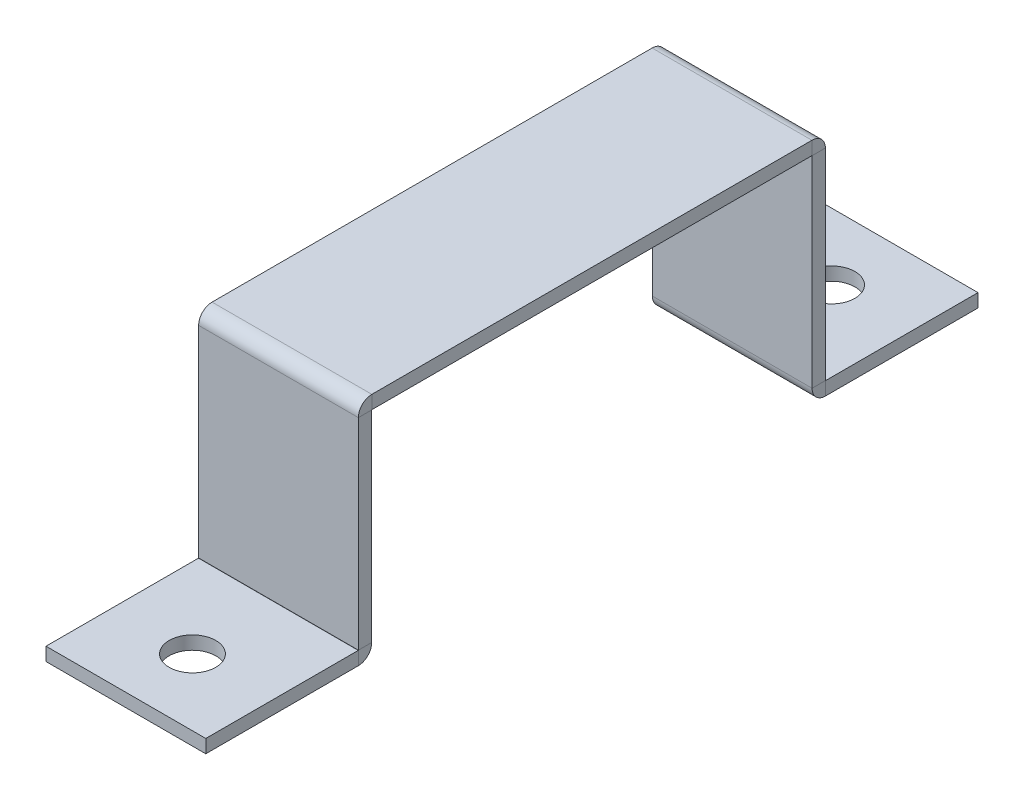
ISO-10303-21;
HEADER;
FILE_DESCRIPTION(('STEP AP214'),'2;1');
FILE_NAME('part.step','',(''),(''),'','','');
FILE_SCHEMA(('AUTOMOTIVE_DESIGN { 1 0 10303 214 1 1 1 1 }'));
ENDSEC;
DATA;
#1=APPLICATION_CONTEXT('core data for automotive mechanical design processes');
#2=APPLICATION_PROTOCOL_DEFINITION('international standard','automotive_design',2000,#1);
#3=PRODUCT_CONTEXT('',#1,'mechanical');
#4=PRODUCT('Part','Part','',(#3));
#5=PRODUCT_RELATED_PRODUCT_CATEGORY('part','',(#4));
#6=PRODUCT_DEFINITION_FORMATION('','',#4);
#7=PRODUCT_DEFINITION_CONTEXT('part definition',#1,'design');
#8=PRODUCT_DEFINITION('design','',#6,#7);
#9=PRODUCT_DEFINITION_SHAPE('','',#8);
#10=(LENGTH_UNIT() NAMED_UNIT(*) SI_UNIT(.MILLI.,.METRE.));
#11=(NAMED_UNIT(*) PLANE_ANGLE_UNIT() SI_UNIT($,.RADIAN.));
#12=(NAMED_UNIT(*) SI_UNIT($,.STERADIAN.) SOLID_ANGLE_UNIT());
#13=UNCERTAINTY_MEASURE_WITH_UNIT(LENGTH_MEASURE(1.E-05),#10,'distance_accuracy_value','');
#14=(GEOMETRIC_REPRESENTATION_CONTEXT(3) GLOBAL_UNCERTAINTY_ASSIGNED_CONTEXT((#13)) GLOBAL_UNIT_ASSIGNED_CONTEXT((#10,
#11,#12)) REPRESENTATION_CONTEXT('',''));
#15=CARTESIAN_POINT('',(0.,0.,0.));
#16=DIRECTION('',(0.,0.,1.));
#17=DIRECTION('',(1.,0.,0.));
#18=AXIS2_PLACEMENT_3D('',#15,#16,#17);
#19=CARTESIAN_POINT('',(0.,62.4635950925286,-62.5364049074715));
#20=DIRECTION('',(1.,0.,0.));
#21=DIRECTION('',(0.,-1.,0.));
#22=AXIS2_PLACEMENT_3D('',#19,#20,#21);
#23=PLANE('',#22);
#24=DIRECTION('',(0.,1.,0.));
#25=VECTOR('',#24,1.);
#26=CARTESIAN_POINT('',(0.,62.4635950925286,-62.5364049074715));
#27=LINE('',#26,#25);
#28=CARTESIAN_POINT('',(0.,-15.1358518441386,-62.5364049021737));
#29=VERTEX_POINT('',#28);
#30=CARTESIAN_POINT('',(0.,-0.0100000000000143,-62.5364049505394));
#31=VERTEX_POINT('',#30);
#32=EDGE_CURVE('E401',#29,#31,#27,.T.);
#33=ORIENTED_EDGE('',*,*,#32,.F.);
#34=DIRECTION('',(0.,0.,1.));
#35=VECTOR('',#34,1.);
#36=CARTESIAN_POINT('',(0.,-15.1358518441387,-62.5364049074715));
#37=LINE('',#36,#35);
#38=CARTESIAN_POINT('',(0.,-15.1358518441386,-61.5364049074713));
#39=VERTEX_POINT('',#38);
#40=EDGE_CURVE('E12',#29,#39,#37,.T.);
#41=ORIENTED_EDGE('',*,*,#40,.T.);
#42=DIRECTION('',(0.,1.,0.));
#43=VECTOR('',#42,1.);
#44=CARTESIAN_POINT('',(0.,62.4635950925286,-61.5364049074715));
#45=LINE('',#44,#43);
#46=CARTESIAN_POINT('',(0.,-0.00999999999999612,-61.5364049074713));
#47=VERTEX_POINT('',#46);
#48=EDGE_CURVE('E321',#39,#47,#45,.T.);
#49=ORIENTED_EDGE('',*,*,#48,.T.);
#50=DIRECTION('',(0.,0.,1.));
#51=VECTOR('',#50,1.);
#52=CARTESIAN_POINT('',(0.,-0.0100000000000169,-62.5364049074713));
#53=LINE('',#52,#51);
#54=EDGE_CURVE('E326',#31,#47,#53,.T.);
#55=ORIENTED_EDGE('',*,*,#54,.F.);
#56=EDGE_LOOP('',(#33,#41,#49,#55));
#57=FACE_BOUND('',#56,.T.);
#58=ADVANCED_FACE('F50',(#57),#23,.F.);
#59=CARTESIAN_POINT('',(12.,62.4635950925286,-62.5364049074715));
#60=DIRECTION('',(-1.,0.,0.));
#61=DIRECTION('',(0.,1.,0.));
#62=AXIS2_PLACEMENT_3D('',#59,#60,#61);
#63=PLANE('',#62);
#64=DIRECTION('',(0.,-1.,0.));
#65=VECTOR('',#64,1.);
#66=CARTESIAN_POINT('',(12.,62.4635950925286,-61.5364049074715));
#67=LINE('',#66,#65);
#68=CARTESIAN_POINT('',(12.,-0.00999999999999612,-61.5364049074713));
#69=VERTEX_POINT('',#68);
#70=CARTESIAN_POINT('',(12.,-15.1358518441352,-61.5364048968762));
#71=VERTEX_POINT('',#70);
#72=EDGE_CURVE('E322',#69,#71,#67,.T.);
#73=ORIENTED_EDGE('',*,*,#72,.T.);
#74=DIRECTION('',(0.,0.,-1.));
#75=VECTOR('',#74,1.);
#76=CARTESIAN_POINT('',(12.,-15.1358518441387,-62.5364049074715));
#77=LINE('',#76,#75);
#78=CARTESIAN_POINT('',(12.,-15.1358518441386,-62.5364049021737));
#79=VERTEX_POINT('',#78);
#80=EDGE_CURVE('E395',#71,#79,#77,.T.);
#81=ORIENTED_EDGE('',*,*,#80,.T.);
#82=DIRECTION('',(0.,-1.,0.));
#83=VECTOR('',#82,1.);
#84=CARTESIAN_POINT('',(12.,62.4635950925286,-62.5364049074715));
#85=LINE('',#84,#83);
#86=CARTESIAN_POINT('',(12.,-0.0100000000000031,-62.5364049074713));
#87=VERTEX_POINT('',#86);
#88=EDGE_CURVE('E53',#87,#79,#85,.T.);
#89=ORIENTED_EDGE('',*,*,#88,.F.);
#90=DIRECTION('',(0.,0.,-1.));
#91=VECTOR('',#90,1.);
#92=CARTESIAN_POINT('',(12.,-0.0100000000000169,-62.5364049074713));
#93=LINE('',#92,#91);
#94=EDGE_CURVE('E323',#69,#87,#93,.T.);
#95=ORIENTED_EDGE('',*,*,#94,.F.);
#96=EDGE_LOOP('',(#73,#81,#89,#95));
#97=FACE_BOUND('',#96,.T.);
#98=ADVANCED_FACE('F411',(#97),#63,.F.);
#99=CARTESIAN_POINT('',(0.,-27.5364049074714,-62.5364049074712));
#100=DIRECTION('',(0.,0.,1.));
#101=DIRECTION('',(0.,-1.,0.));
#102=AXIS2_PLACEMENT_3D('',#99,#100,#101);
#103=PLANE('',#102);
#104=ORIENTED_EDGE('',*,*,#88,.T.);
#105=DIRECTION('',(-1.,0.,0.));
#106=VECTOR('',#105,1.);
#107=CARTESIAN_POINT('',(0.,-15.1358518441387,-62.5364049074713));
#108=LINE('',#107,#106);
#109=EDGE_CURVE('E386',#79,#29,#108,.T.);
#110=ORIENTED_EDGE('',*,*,#109,.T.);
#111=ORIENTED_EDGE('',*,*,#32,.T.);
#112=DIRECTION('',(-1.,0.,0.));
#113=VECTOR('',#112,1.);
#114=CARTESIAN_POINT('',(0.,-0.0100000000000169,-62.5364049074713));
#115=LINE('',#114,#113);
#116=EDGE_CURVE('E317',#87,#31,#115,.T.);
#117=ORIENTED_EDGE('',*,*,#116,.F.);
#118=EDGE_LOOP('',(#104,#110,#111,#117));
#119=FACE_BOUND('',#118,.T.);
#120=ADVANCED_FACE('F407',(#119),#103,.F.);
#121=CARTESIAN_POINT('',(12.,-27.5364049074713,-27.4635950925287));
#122=DIRECTION('',(-1.,0.,0.));
#123=DIRECTION('',(0.,-1.,0.));
#124=AXIS2_PLACEMENT_3D('',#121,#122,#123);
#125=PLANE('',#124);
#126=DIRECTION('',(0.,1.,0.));
#127=VECTOR('',#126,1.);
#128=CARTESIAN_POINT('',(12.,-27.5364049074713,-27.4635950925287));
#129=LINE('',#128,#127);
#130=CARTESIAN_POINT('',(12.,-15.1358518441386,-27.4635950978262));
#131=VERTEX_POINT('',#130);
#132=CARTESIAN_POINT('',(12.,-0.0100000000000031,-27.4635950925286));
#133=VERTEX_POINT('',#132);
#134=EDGE_CURVE('E303',#131,#133,#129,.T.);
#135=ORIENTED_EDGE('',*,*,#134,.F.);
#136=DIRECTION('',(0.,0.,-1.));
#137=VECTOR('',#136,1.);
#138=CARTESIAN_POINT('',(12.,-15.1358518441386,-27.4635950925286));
#139=LINE('',#138,#137);
#140=CARTESIAN_POINT('',(12.,-15.1358518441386,-28.4635950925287));
#141=VERTEX_POINT('',#140);
#142=EDGE_CURVE('E383',#131,#141,#139,.T.);
#143=ORIENTED_EDGE('',*,*,#142,.T.);
#144=DIRECTION('',(0.,1.,0.));
#145=VECTOR('',#144,1.);
#146=CARTESIAN_POINT('',(12.,-27.5364049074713,-28.4635950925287));
#147=LINE('',#146,#145);
#148=CARTESIAN_POINT('',(12.,-0.00999999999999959,-28.4635950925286));
#149=VERTEX_POINT('',#148);
#150=EDGE_CURVE('E294',#141,#149,#147,.T.);
#151=ORIENTED_EDGE('',*,*,#150,.T.);
#152=DIRECTION('',(0.,0.,1.));
#153=VECTOR('',#152,1.);
#154=CARTESIAN_POINT('',(12.,-0.00999999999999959,-27.4635950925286));
#155=LINE('',#154,#153);
#156=EDGE_CURVE('E290',#149,#133,#155,.T.);
#157=ORIENTED_EDGE('',*,*,#156,.T.);
#158=EDGE_LOOP('',(#135,#143,#151,#157));
#159=FACE_BOUND('',#158,.T.);
#160=ADVANCED_FACE('F480',(#159),#125,.F.);
#161=CARTESIAN_POINT('',(0.,-27.5364049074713,-27.4635950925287));
#162=DIRECTION('',(1.,0.,0.));
#163=DIRECTION('',(0.,1.,0.));
#164=AXIS2_PLACEMENT_3D('',#161,#162,#163);
#165=PLANE('',#164);
#166=DIRECTION('',(0.,-1.,0.));
#167=VECTOR('',#166,1.);
#168=CARTESIAN_POINT('',(0.,-27.5364049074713,-28.4635950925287));
#169=LINE('',#168,#167);
#170=CARTESIAN_POINT('',(0.,-0.00999999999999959,-28.4635950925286));
#171=VERTEX_POINT('',#170);
#172=CARTESIAN_POINT('',(0.,-15.1358518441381,-28.4635951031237));
#173=VERTEX_POINT('',#172);
#174=EDGE_CURVE('E298',#171,#173,#169,.T.);
#175=ORIENTED_EDGE('',*,*,#174,.T.);
#176=DIRECTION('',(0.,0.,1.));
#177=VECTOR('',#176,1.);
#178=CARTESIAN_POINT('',(0.,-15.1358518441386,-27.4635950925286));
#179=LINE('',#178,#177);
#180=CARTESIAN_POINT('',(0.,-15.1358518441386,-27.4635950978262));
#181=VERTEX_POINT('',#180);
#182=EDGE_CURVE('E379',#173,#181,#179,.T.);
#183=ORIENTED_EDGE('',*,*,#182,.T.);
#184=DIRECTION('',(0.,-1.,0.));
#185=VECTOR('',#184,1.);
#186=CARTESIAN_POINT('',(0.,-27.5364049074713,-27.4635950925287));
#187=LINE('',#186,#185);
#188=CARTESIAN_POINT('',(0.,-0.00999999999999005,-27.4635951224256));
#189=VERTEX_POINT('',#188);
#190=EDGE_CURVE('E299',#189,#181,#187,.T.);
#191=ORIENTED_EDGE('',*,*,#190,.F.);
#192=DIRECTION('',(0.,0.,-1.));
#193=VECTOR('',#192,1.);
#194=CARTESIAN_POINT('',(0.,-0.00999999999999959,-27.4635950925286));
#195=LINE('',#194,#193);
#196=EDGE_CURVE('E295',#189,#171,#195,.T.);
#197=ORIENTED_EDGE('',*,*,#196,.T.);
#198=EDGE_LOOP('',(#175,#183,#191,#197));
#199=FACE_BOUND('',#198,.T.);
#200=ADVANCED_FACE('F485',(#199),#165,.F.);
#201=CARTESIAN_POINT('',(0.,62.4635950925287,-27.4635950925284));
#202=DIRECTION('',(0.,0.,-1.));
#203=DIRECTION('',(0.,1.,0.));
#204=AXIS2_PLACEMENT_3D('',#201,#202,#203);
#205=PLANE('',#204);
#206=ORIENTED_EDGE('',*,*,#190,.T.);
#207=DIRECTION('',(1.,0.,0.));
#208=VECTOR('',#207,1.);
#209=CARTESIAN_POINT('',(0.,-15.1358518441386,-27.4635950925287));
#210=LINE('',#209,#208);
#211=EDGE_CURVE('E368',#181,#131,#210,.T.);
#212=ORIENTED_EDGE('',*,*,#211,.T.);
#213=ORIENTED_EDGE('',*,*,#134,.T.);
#214=DIRECTION('',(-1.,0.,0.));
#215=VECTOR('',#214,1.);
#216=CARTESIAN_POINT('',(0.,-0.00999999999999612,-27.4635950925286));
#217=LINE('',#216,#215);
#218=EDGE_CURVE('E300',#133,#189,#217,.T.);
#219=ORIENTED_EDGE('',*,*,#218,.T.);
#220=EDGE_LOOP('',(#206,#212,#213,#219));
#221=FACE_BOUND('',#220,.T.);
#222=ADVANCED_FACE('F495',(#221),#205,.F.);
#223=CARTESIAN_POINT('',(0.,0.,-90.));
#224=DIRECTION('',(0.,-1.,0.));
#225=DIRECTION('',(0.,0.,-1.));
#226=AXIS2_PLACEMENT_3D('',#223,#224,#225);
#227=PLANE('',#226);
#228=DIRECTION('',(0.,0.,-1.));
#229=VECTOR('',#228,1.);
#230=CARTESIAN_POINT('',(12.,0.,0.));
#231=LINE('',#230,#229);
#232=CARTESIAN_POINT('',(12.,0.,-28.4735950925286));
#233=VERTEX_POINT('',#232);
#234=CARTESIAN_POINT('',(12.,4.30680556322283E-08,-61.5264049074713));
#235=VERTEX_POINT('',#234);
#236=EDGE_CURVE('E369',#233,#235,#231,.T.);
#237=ORIENTED_EDGE('',*,*,#236,.F.);
#238=DIRECTION('',(-1.,0.,0.));
#239=VECTOR('',#238,1.);
#240=CARTESIAN_POINT('',(0.,0.,-28.4735950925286));
#241=LINE('',#240,#239);
#242=CARTESIAN_POINT('',(0.,0.,-28.4735950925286));
#243=VERTEX_POINT('',#242);
#244=EDGE_CURVE('E362',#233,#243,#241,.T.);
#245=ORIENTED_EDGE('',*,*,#244,.T.);
#246=DIRECTION('',(0.,0.,1.));
#247=VECTOR('',#246,1.);
#248=CARTESIAN_POINT('',(0.,0.,0.));
#249=LINE('',#248,#247);
#250=CARTESIAN_POINT('',(0.,0.,-61.5264049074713));
#251=VERTEX_POINT('',#250);
#252=EDGE_CURVE('E343',#251,#243,#249,.T.);
#253=ORIENTED_EDGE('',*,*,#252,.F.);
#254=DIRECTION('',(-1.,0.,0.));
#255=VECTOR('',#254,1.);
#256=CARTESIAN_POINT('',(0.,0.,-61.5264049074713));
#257=LINE('',#256,#255);
#258=EDGE_CURVE('E351',#235,#251,#257,.T.);
#259=ORIENTED_EDGE('',*,*,#258,.F.);
#260=EDGE_LOOP('',(#237,#245,#253,#259));
#261=FACE_BOUND('',#260,.T.);
#262=ADVANCED_FACE('F499',(#261),#227,.T.);
#263=CARTESIAN_POINT('',(12.,1.,0.));
#264=DIRECTION('',(-1.,0.,0.));
#265=DIRECTION('',(0.,0.,1.));
#266=AXIS2_PLACEMENT_3D('',#263,#264,#265);
#267=PLANE('',#266);
#268=DIRECTION('',(0.,1.,0.));
#269=VECTOR('',#268,1.);
#270=CARTESIAN_POINT('',(12.,0.999999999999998,-28.4735950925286));
#271=LINE('',#270,#269);
#272=CARTESIAN_POINT('',(12.,0.99999999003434,-28.4735950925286));
#273=VERTEX_POINT('',#272);
#274=EDGE_CURVE('E365',#233,#273,#271,.T.);
#275=ORIENTED_EDGE('',*,*,#274,.F.);
#276=ORIENTED_EDGE('',*,*,#236,.T.);
#277=DIRECTION('',(0.,1.,0.));
#278=VECTOR('',#277,1.);
#279=CARTESIAN_POINT('',(12.,0.999999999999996,-61.5264049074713));
#280=LINE('',#279,#278);
#281=CARTESIAN_POINT('',(12.,1.00000002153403,-61.5264049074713));
#282=VERTEX_POINT('',#281);
#283=EDGE_CURVE('E347',#235,#282,#280,.T.);
#284=ORIENTED_EDGE('',*,*,#283,.T.);
#285=DIRECTION('',(0.,0.,-1.));
#286=VECTOR('',#285,1.);
#287=CARTESIAN_POINT('',(12.,1.,0.));
#288=LINE('',#287,#286);
#289=EDGE_CURVE('E348',#273,#282,#288,.T.);
#290=ORIENTED_EDGE('',*,*,#289,.F.);
#291=EDGE_LOOP('',(#275,#276,#284,#290));
#292=FACE_BOUND('',#291,.T.);
#293=ADVANCED_FACE('F452',(#292),#267,.F.);
#294=CARTESIAN_POINT('',(0.,1.,0.));
#295=DIRECTION('',(1.,0.,0.));
#296=DIRECTION('',(0.,0.,-1.));
#297=AXIS2_PLACEMENT_3D('',#294,#295,#296);
#298=PLANE('',#297);
#299=DIRECTION('',(0.,-1.,0.));
#300=VECTOR('',#299,1.);
#301=CARTESIAN_POINT('',(0.,0.999999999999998,-28.4735950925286));
#302=LINE('',#301,#300);
#303=CARTESIAN_POINT('',(0.,1.,-28.4735950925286));
#304=VERTEX_POINT('',#303);
#305=EDGE_CURVE('E359',#304,#243,#302,.T.);
#306=ORIENTED_EDGE('',*,*,#305,.F.);
#307=DIRECTION('',(0.,0.,1.));
#308=VECTOR('',#307,1.);
#309=CARTESIAN_POINT('',(0.,1.,0.));
#310=LINE('',#309,#308);
#311=CARTESIAN_POINT('',(0.,1.00000002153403,-61.5264049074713));
#312=VERTEX_POINT('',#311);
#313=EDGE_CURVE('E372',#312,#304,#310,.T.);
#314=ORIENTED_EDGE('',*,*,#313,.F.);
#315=DIRECTION('',(0.,-1.,0.));
#316=VECTOR('',#315,1.);
#317=CARTESIAN_POINT('',(0.,0.999999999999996,-61.5264049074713));
#318=LINE('',#317,#316);
#319=EDGE_CURVE('E353',#312,#251,#318,.T.);
#320=ORIENTED_EDGE('',*,*,#319,.T.);
#321=ORIENTED_EDGE('',*,*,#252,.T.);
#322=EDGE_LOOP('',(#306,#314,#320,#321));
#323=FACE_BOUND('',#322,.T.);
#324=ADVANCED_FACE('F446',(#323),#298,.F.);
#325=CARTESIAN_POINT('',(0.,1.,-90.));
#326=DIRECTION('',(0.,-1.,0.));
#327=DIRECTION('',(0.,0.,-1.));
#328=AXIS2_PLACEMENT_3D('',#325,#326,#327);
#329=PLANE('',#328);
#330=DIRECTION('',(-1.,0.,0.));
#331=VECTOR('',#330,1.);
#332=CARTESIAN_POINT('',(0.,1.,-28.4735950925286));
#333=LINE('',#332,#331);
#334=EDGE_CURVE('E356',#273,#304,#333,.T.);
#335=ORIENTED_EDGE('',*,*,#334,.F.);
#336=ORIENTED_EDGE('',*,*,#289,.T.);
#337=DIRECTION('',(-1.,0.,0.));
#338=VECTOR('',#337,1.);
#339=CARTESIAN_POINT('',(0.,1.,-61.5264049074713));
#340=LINE('',#339,#338);
#341=EDGE_CURVE('E344',#282,#312,#340,.T.);
#342=ORIENTED_EDGE('',*,*,#341,.T.);
#343=ORIENTED_EDGE('',*,*,#313,.T.);
#344=EDGE_LOOP('',(#335,#336,#342,#343));
#345=FACE_BOUND('',#344,.T.);
#346=ADVANCED_FACE('F449',(#345),#329,.F.);
#347=CARTESIAN_POINT('',(12.,-0.0100000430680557,-61.5264049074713));
#348=DIRECTION('',(1.,0.,0.));
#349=DIRECTION('',(0.,0.,-1.));
#350=AXIS2_PLACEMENT_3D('',#347,#348,#349);
#351=PLANE('',#350);
#352=ORIENTED_EDGE('',*,*,#283,.F.);
#353=CARTESIAN_POINT('',(12.,-0.01,-61.5264049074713));
#354=DIRECTION('',(-1.,0.,0.));
#355=DIRECTION('',(0.,0.,1.));
#356=AXIS2_PLACEMENT_3D('',#353,#354,#355);
#357=CIRCLE('',#356,0.0100000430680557);
#358=EDGE_CURVE('E335',#235,#69,#357,.T.);
#359=ORIENTED_EDGE('',*,*,#358,.T.);
#360=ORIENTED_EDGE('',*,*,#94,.T.);
#361=CARTESIAN_POINT('',(12.,-0.0100000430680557,-61.5264049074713));
#362=DIRECTION('',(-1.,0.,0.));
#363=DIRECTION('',(0.,0.,1.));
#364=AXIS2_PLACEMENT_3D('',#361,#362,#363);
#365=CIRCLE('',#364,1.01000006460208);
#366=EDGE_CURVE('E334',#282,#87,#365,.T.);
#367=ORIENTED_EDGE('',*,*,#366,.F.);
#368=EDGE_LOOP('',(#352,#359,#360,#367));
#369=FACE_BOUND('',#368,.T.);
#370=ADVANCED_FACE('F456',(#369),#351,.T.);
#371=CARTESIAN_POINT('',(0.,-0.0100000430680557,-61.5264049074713));
#372=DIRECTION('',(-1.,0.,0.));
#373=DIRECTION('',(0.,0.,1.));
#374=AXIS2_PLACEMENT_3D('',#371,#372,#373);
#375=PLANE('',#374);
#376=ORIENTED_EDGE('',*,*,#54,.T.);
#377=CARTESIAN_POINT('',(0.,-0.01,-61.5264049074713));
#378=DIRECTION('',(-1.,0.,0.));
#379=DIRECTION('',(0.,0.,1.));
#380=AXIS2_PLACEMENT_3D('',#377,#378,#379);
#381=CIRCLE('',#380,0.0100000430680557);
#382=EDGE_CURVE('E331',#47,#251,#381,.F.);
#383=ORIENTED_EDGE('',*,*,#382,.T.);
#384=ORIENTED_EDGE('',*,*,#319,.F.);
#385=CARTESIAN_POINT('',(0.,-0.0100000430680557,-61.5264049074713));
#386=DIRECTION('',(1.,0.,0.));
#387=DIRECTION('',(0.,0.,-1.));
#388=AXIS2_PLACEMENT_3D('',#385,#386,#387);
#389=CIRCLE('',#388,1.01000006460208);
#390=EDGE_CURVE('E340',#31,#312,#389,.T.);
#391=ORIENTED_EDGE('',*,*,#390,.F.);
#392=EDGE_LOOP('',(#376,#383,#384,#391));
#393=FACE_BOUND('',#392,.T.);
#394=ADVANCED_FACE('F441',(#393),#375,.T.);
#395=CARTESIAN_POINT('',(18.0787900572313,-0.01,-61.5264049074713));
#396=DIRECTION('',(-1.,0.,0.));
#397=DIRECTION('',(0.,0.,1.));
#398=AXIS2_PLACEMENT_3D('',#395,#396,#397);
#399=CYLINDRICAL_SURFACE('',#398,1.01000004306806);
#400=ORIENTED_EDGE('',*,*,#390,.T.);
#401=ORIENTED_EDGE('',*,*,#341,.F.);
#402=ORIENTED_EDGE('',*,*,#366,.T.);
#403=ORIENTED_EDGE('',*,*,#116,.T.);
#404=EDGE_LOOP('',(#400,#401,#402,#403));
#405=FACE_BOUND('',#404,.T.);
#406=ADVANCED_FACE('F439',(#405),#399,.T.);
#407=CARTESIAN_POINT('',(18.0787900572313,-0.01,-61.5264049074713));
#408=DIRECTION('',(-1.,0.,0.));
#409=DIRECTION('',(0.,0.,1.));
#410=AXIS2_PLACEMENT_3D('',#407,#408,#409);
#411=CYLINDRICAL_SURFACE('',#410,0.0100000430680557);
#412=ORIENTED_EDGE('',*,*,#382,.F.);
#413=DIRECTION('',(-1.,0.,0.));
#414=VECTOR('',#413,1.);
#415=CARTESIAN_POINT('',(0.,-0.01000000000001,-61.5364049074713));
#416=LINE('',#415,#414);
#417=EDGE_CURVE('E318',#69,#47,#416,.T.);
#418=ORIENTED_EDGE('',*,*,#417,.F.);
#419=ORIENTED_EDGE('',*,*,#358,.F.);
#420=ORIENTED_EDGE('',*,*,#258,.T.);
#421=EDGE_LOOP('',(#412,#418,#419,#420));
#422=FACE_BOUND('',#421,.T.);
#423=ADVANCED_FACE('F459',(#422),#411,.F.);
#424=CARTESIAN_POINT('',(0.,-27.5364049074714,-61.5364049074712));
#425=DIRECTION('',(0.,0.,1.));
#426=DIRECTION('',(0.,-1.,0.));
#427=AXIS2_PLACEMENT_3D('',#424,#425,#426);
#428=PLANE('',#427);
#429=DIRECTION('',(-1.,0.,0.));
#430=VECTOR('',#429,1.);
#431=CARTESIAN_POINT('',(0.,-15.1358518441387,-61.5364049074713));
#432=LINE('',#431,#430);
#433=EDGE_CURVE('E58',#71,#39,#432,.T.);
#434=ORIENTED_EDGE('',*,*,#433,.F.);
#435=ORIENTED_EDGE('',*,*,#72,.F.);
#436=ORIENTED_EDGE('',*,*,#417,.T.);
#437=ORIENTED_EDGE('',*,*,#48,.F.);
#438=EDGE_LOOP('',(#434,#435,#436,#437));
#439=FACE_BOUND('',#438,.T.);
#440=ADVANCED_FACE('F461',(#439),#428,.T.);
#441=CARTESIAN_POINT('',(12.,-0.00999998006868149,-28.4735950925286));
#442=DIRECTION('',(1.,0.,0.));
#443=DIRECTION('',(0.,0.,-1.));
#444=AXIS2_PLACEMENT_3D('',#441,#442,#443);
#445=PLANE('',#444);
#446=ORIENTED_EDGE('',*,*,#156,.F.);
#447=CARTESIAN_POINT('',(12.,-0.01,-28.4735950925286));
#448=DIRECTION('',(1.,0.,0.));
#449=DIRECTION('',(0.,0.,-1.));
#450=AXIS2_PLACEMENT_3D('',#447,#448,#449);
#451=CIRCLE('',#450,0.00999998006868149);
#452=EDGE_CURVE('E293',#149,#233,#451,.F.);
#453=ORIENTED_EDGE('',*,*,#452,.T.);
#454=ORIENTED_EDGE('',*,*,#274,.T.);
#455=CARTESIAN_POINT('',(12.,-0.00999998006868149,-28.4735950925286));
#456=DIRECTION('',(-1.,0.,0.));
#457=DIRECTION('',(0.,0.,1.));
#458=AXIS2_PLACEMENT_3D('',#455,#456,#457);
#459=CIRCLE('',#458,1.00999997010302);
#460=EDGE_CURVE('E309',#133,#273,#459,.T.);
#461=ORIENTED_EDGE('',*,*,#460,.F.);
#462=EDGE_LOOP('',(#446,#453,#454,#461));
#463=FACE_BOUND('',#462,.T.);
#464=ADVANCED_FACE('F463',(#463),#445,.T.);
#465=CARTESIAN_POINT('',(0.,-0.00999998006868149,-28.4735950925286));
#466=DIRECTION('',(-1.,0.,0.));
#467=DIRECTION('',(0.,0.,1.));
#468=AXIS2_PLACEMENT_3D('',#465,#466,#467);
#469=PLANE('',#468);
#470=ORIENTED_EDGE('',*,*,#305,.T.);
#471=CARTESIAN_POINT('',(0.,-0.01,-28.4735950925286));
#472=DIRECTION('',(1.,0.,0.));
#473=DIRECTION('',(0.,0.,-1.));
#474=AXIS2_PLACEMENT_3D('',#471,#472,#473);
#475=CIRCLE('',#474,0.00999998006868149);
#476=EDGE_CURVE('E306',#243,#171,#475,.T.);
#477=ORIENTED_EDGE('',*,*,#476,.T.);
#478=ORIENTED_EDGE('',*,*,#196,.F.);
#479=CARTESIAN_POINT('',(0.,-0.00999998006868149,-28.4735950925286));
#480=DIRECTION('',(1.,0.,0.));
#481=DIRECTION('',(0.,0.,-1.));
#482=AXIS2_PLACEMENT_3D('',#479,#480,#481);
#483=CIRCLE('',#482,1.00999997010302);
#484=EDGE_CURVE('E314',#304,#189,#483,.T.);
#485=ORIENTED_EDGE('',*,*,#484,.F.);
#486=EDGE_LOOP('',(#470,#477,#478,#485));
#487=FACE_BOUND('',#486,.T.);
#488=ADVANCED_FACE('F468',(#487),#469,.T.);
#489=CARTESIAN_POINT('',(-6.07879005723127,-0.01,-28.4735950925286));
#490=DIRECTION('',(1.,0.,0.));
#491=DIRECTION('',(0.,0.,-1.));
#492=AXIS2_PLACEMENT_3D('',#489,#490,#491);
#493=CYLINDRICAL_SURFACE('',#492,1.00999998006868);
#494=ORIENTED_EDGE('',*,*,#484,.T.);
#495=ORIENTED_EDGE('',*,*,#218,.F.);
#496=ORIENTED_EDGE('',*,*,#460,.T.);
#497=ORIENTED_EDGE('',*,*,#334,.T.);
#498=EDGE_LOOP('',(#494,#495,#496,#497));
#499=FACE_BOUND('',#498,.T.);
#500=ADVANCED_FACE('F518',(#499),#493,.T.);
#501=CARTESIAN_POINT('',(-6.07879005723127,-0.01,-28.4735950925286));
#502=DIRECTION('',(1.,0.,0.));
#503=DIRECTION('',(0.,0.,-1.));
#504=AXIS2_PLACEMENT_3D('',#501,#502,#503);
#505=CYLINDRICAL_SURFACE('',#504,0.00999998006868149);
#506=ORIENTED_EDGE('',*,*,#476,.F.);
#507=ORIENTED_EDGE('',*,*,#244,.F.);
#508=ORIENTED_EDGE('',*,*,#452,.F.);
#509=DIRECTION('',(-1.,0.,0.));
#510=VECTOR('',#509,1.);
#511=CARTESIAN_POINT('',(0.,-0.00999999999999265,-28.4635950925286));
#512=LINE('',#511,#510);
#513=EDGE_CURVE('E289',#149,#171,#512,.T.);
#514=ORIENTED_EDGE('',*,*,#513,.T.);
#515=EDGE_LOOP('',(#506,#507,#508,#514));
#516=FACE_BOUND('',#515,.T.);
#517=ADVANCED_FACE('F491',(#516),#505,.F.);
#518=CARTESIAN_POINT('',(0.,62.4635950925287,-28.4635950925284));
#519=DIRECTION('',(0.,0.,-1.));
#520=DIRECTION('',(0.,1.,0.));
#521=AXIS2_PLACEMENT_3D('',#518,#519,#520);
#522=PLANE('',#521);
#523=DIRECTION('',(1.,0.,0.));
#524=VECTOR('',#523,1.);
#525=CARTESIAN_POINT('',(0.,-15.1358518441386,-28.4635950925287));
#526=LINE('',#525,#524);
#527=EDGE_CURVE('E73',#173,#141,#526,.T.);
#528=ORIENTED_EDGE('',*,*,#527,.F.);
#529=ORIENTED_EDGE('',*,*,#174,.F.);
#530=ORIENTED_EDGE('',*,*,#513,.F.);
#531=ORIENTED_EDGE('',*,*,#150,.F.);
#532=EDGE_LOOP('',(#528,#529,#530,#531));
#533=FACE_BOUND('',#532,.T.);
#534=ADVANCED_FACE('F487',(#533),#522,.T.);
#535=CARTESIAN_POINT('',(0.,-15.1358518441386,-27.4535950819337));
#536=DIRECTION('',(1.,0.,0.));
#537=DIRECTION('',(0.,0.,-1.));
#538=AXIS2_PLACEMENT_3D('',#535,#536,#537);
#539=PLANE('',#538);
#540=ORIENTED_EDGE('',*,*,#182,.F.);
#541=CARTESIAN_POINT('',(0.,-15.1358518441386,-27.4535950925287));
#542=DIRECTION('',(1.,0.,0.));
#543=DIRECTION('',(0.,0.,-1.));
#544=AXIS2_PLACEMENT_3D('',#541,#542,#543);
#545=CIRCLE('',#544,1.01000001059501);
#546=CARTESIAN_POINT('',(0.,-16.1458518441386,-27.4535950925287));
#547=VERTEX_POINT('',#546);
#548=EDGE_CURVE('E244',#173,#547,#545,.F.);
#549=ORIENTED_EDGE('',*,*,#548,.T.);
#550=DIRECTION('',(0.,1.,0.));
#551=VECTOR('',#550,1.);
#552=CARTESIAN_POINT('',(0.,-15.1458518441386,-27.4535950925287));
#553=LINE('',#552,#551);
#554=CARTESIAN_POINT('',(0.,-15.1458518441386,-27.4535950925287));
#555=VERTEX_POINT('',#554);
#556=EDGE_CURVE('E271',#547,#555,#553,.T.);
#557=ORIENTED_EDGE('',*,*,#556,.T.);
#558=CARTESIAN_POINT('',(0.,-15.1358518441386,-27.4535950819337));
#559=DIRECTION('',(-1.,0.,0.));
#560=DIRECTION('',(0.,0.,1.));
#561=AXIS2_PLACEMENT_3D('',#558,#559,#560);
#562=CIRCLE('',#561,0.0100000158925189);
#563=EDGE_CURVE('E281',#181,#555,#562,.T.);
#564=ORIENTED_EDGE('',*,*,#563,.F.);
#565=EDGE_LOOP('',(#540,#549,#557,#564));
#566=FACE_BOUND('',#565,.T.);
#567=ADVANCED_FACE('F490',(#566),#539,.F.);
#568=CARTESIAN_POINT('',(12.,-15.1358518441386,-27.4535950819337));
#569=DIRECTION('',(-1.,0.,0.));
#570=DIRECTION('',(0.,0.,1.));
#571=AXIS2_PLACEMENT_3D('',#568,#569,#570);
#572=PLANE('',#571);
#573=DIRECTION('',(0.,-1.,0.));
#574=VECTOR('',#573,1.);
#575=CARTESIAN_POINT('',(12.,-15.1458518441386,-27.4535950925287));
#576=LINE('',#575,#574);
#577=CARTESIAN_POINT('',(12.,-15.1458518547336,-27.4535950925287));
#578=VERTEX_POINT('',#577);
#579=CARTESIAN_POINT('',(12.,-16.1458518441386,-27.4535950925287));
#580=VERTEX_POINT('',#579);
#581=EDGE_CURVE('E274',#578,#580,#576,.T.);
#582=ORIENTED_EDGE('',*,*,#581,.T.);
#583=CARTESIAN_POINT('',(12.,-15.1358518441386,-27.4535950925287));
#584=DIRECTION('',(1.,0.,0.));
#585=DIRECTION('',(0.,0.,-1.));
#586=AXIS2_PLACEMENT_3D('',#583,#584,#585);
#587=CIRCLE('',#586,1.01000001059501);
#588=EDGE_CURVE('E279',#580,#141,#587,.T.);
#589=ORIENTED_EDGE('',*,*,#588,.T.);
#590=ORIENTED_EDGE('',*,*,#142,.F.);
#591=CARTESIAN_POINT('',(12.,-15.1358518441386,-27.4535950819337));
#592=DIRECTION('',(1.,0.,0.));
#593=DIRECTION('',(0.,0.,-1.));
#594=AXIS2_PLACEMENT_3D('',#591,#592,#593);
#595=CIRCLE('',#594,0.0100000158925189);
#596=EDGE_CURVE('E286',#578,#131,#595,.T.);
#597=ORIENTED_EDGE('',*,*,#596,.F.);
#598=EDGE_LOOP('',(#582,#589,#590,#597));
#599=FACE_BOUND('',#598,.T.);
#600=ADVANCED_FACE('F528',(#599),#572,.F.);
#601=CARTESIAN_POINT('',(-6.07879005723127,-15.1358518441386,-27.4535950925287));
#602=DIRECTION('',(1.,0.,0.));
#603=DIRECTION('',(0.,0.,-1.));
#604=AXIS2_PLACEMENT_3D('',#601,#602,#603);
#605=CYLINDRICAL_SURFACE('',#604,0.01000001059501);
#606=ORIENTED_EDGE('',*,*,#596,.T.);
#607=ORIENTED_EDGE('',*,*,#211,.F.);
#608=ORIENTED_EDGE('',*,*,#563,.T.);
#609=DIRECTION('',(1.,0.,0.));
#610=VECTOR('',#609,1.);
#611=CARTESIAN_POINT('',(0.,-15.1458518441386,-27.4535950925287));
#612=LINE('',#611,#610);
#613=EDGE_CURVE('E241',#555,#578,#612,.T.);
#614=ORIENTED_EDGE('',*,*,#613,.T.);
#615=EDGE_LOOP('',(#606,#607,#608,#614));
#616=FACE_BOUND('',#615,.T.);
#617=ADVANCED_FACE('F532',(#616),#605,.F.);
#618=CARTESIAN_POINT('',(-6.07879005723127,-15.1358518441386,-27.4535950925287));
#619=DIRECTION('',(1.,0.,0.));
#620=DIRECTION('',(0.,0.,-1.));
#621=AXIS2_PLACEMENT_3D('',#618,#619,#620);
#622=CYLINDRICAL_SURFACE('',#621,1.01000001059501);
#623=ORIENTED_EDGE('',*,*,#588,.F.);
#624=DIRECTION('',(1.,0.,0.));
#625=VECTOR('',#624,1.);
#626=CARTESIAN_POINT('',(0.,-16.1458518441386,-27.4535950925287));
#627=LINE('',#626,#625);
#628=EDGE_CURVE('E248',#547,#580,#627,.T.);
#629=ORIENTED_EDGE('',*,*,#628,.F.);
#630=ORIENTED_EDGE('',*,*,#548,.F.);
#631=ORIENTED_EDGE('',*,*,#527,.T.);
#632=EDGE_LOOP('',(#623,#629,#630,#631));
#633=FACE_BOUND('',#632,.T.);
#634=ADVANCED_FACE('F536',(#633),#622,.T.);
#635=CARTESIAN_POINT('',(6.,-15.1458518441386,-21.0002322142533));
#636=DIRECTION('',(0.,-1.,0.));
#637=DIRECTION('',(0.,0.,-1.));
#638=AXIS2_PLACEMENT_3D('',#635,#636,#637);
#639=CYLINDRICAL_SURFACE('',#638,1.75);
#640=CARTESIAN_POINT('',(6.,-15.1458518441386,-21.0002322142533));
#641=DIRECTION('',(0.,1.,0.));
#642=DIRECTION('',(0.,0.,1.));
#643=AXIS2_PLACEMENT_3D('',#640,#641,#642);
#644=CIRCLE('',#643,1.75);
#645=CARTESIAN_POINT('',(6.,-15.1458518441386,-19.2502322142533));
#646=VERTEX_POINT('',#645);
#647=EDGE_CURVE('E268',#646,#646,#644,.T.);
#648=ORIENTED_EDGE('',*,*,#647,.T.);
#649=EDGE_LOOP('',(#648));
#650=FACE_BOUND('',#649,.T.);
#651=CARTESIAN_POINT('',(6.,-16.1458518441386,-21.0002322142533));
#652=DIRECTION('',(0.,1.,0.));
#653=DIRECTION('',(0.,0.,1.));
#654=AXIS2_PLACEMENT_3D('',#651,#652,#653);
#655=CIRCLE('',#654,1.75);
#656=CARTESIAN_POINT('',(6.,-16.1458518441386,-19.2502322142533));
#657=VERTEX_POINT('',#656);
#658=EDGE_CURVE('E251',#657,#657,#655,.T.);
#659=ORIENTED_EDGE('',*,*,#658,.F.);
#660=EDGE_LOOP('',(#659));
#661=FACE_BOUND('',#660,.T.);
#662=ADVANCED_FACE('F540',(#650,#661),#639,.F.);
#663=CARTESIAN_POINT('',(0.,-15.1458518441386,-16.0002322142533));
#664=DIRECTION('',(0.,0.,-1.));
#665=DIRECTION('',(-1.,0.,0.));
#666=AXIS2_PLACEMENT_3D('',#663,#664,#665);
#667=PLANE('',#666);
#668=DIRECTION('',(1.,0.,0.));
#669=VECTOR('',#668,1.);
#670=CARTESIAN_POINT('',(0.,-16.1458518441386,-16.0002322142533));
#671=LINE('',#670,#669);
#672=CARTESIAN_POINT('',(0.,-16.1458518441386,-16.0002322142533));
#673=VERTEX_POINT('',#672);
#674=CARTESIAN_POINT('',(12.,-16.1458518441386,-16.0002322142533));
#675=VERTEX_POINT('',#674);
#676=EDGE_CURVE('E266',#673,#675,#671,.T.);
#677=ORIENTED_EDGE('',*,*,#676,.T.);
#678=DIRECTION('',(0.,-1.,0.));
#679=VECTOR('',#678,1.);
#680=CARTESIAN_POINT('',(12.,-15.1458518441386,-16.0002322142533));
#681=LINE('',#680,#679);
#682=CARTESIAN_POINT('',(12.,-15.1458518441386,-16.0002322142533));
#683=VERTEX_POINT('',#682);
#684=EDGE_CURVE('E245',#683,#675,#681,.T.);
#685=ORIENTED_EDGE('',*,*,#684,.F.);
#686=DIRECTION('',(1.,0.,0.));
#687=VECTOR('',#686,1.);
#688=CARTESIAN_POINT('',(0.,-15.1458518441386,-16.0002322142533));
#689=LINE('',#688,#687);
#690=CARTESIAN_POINT('',(0.,-15.1458518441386,-16.0002322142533));
#691=VERTEX_POINT('',#690);
#692=EDGE_CURVE('E259',#691,#683,#689,.T.);
#693=ORIENTED_EDGE('',*,*,#692,.F.);
#694=DIRECTION('',(0.,-1.,0.));
#695=VECTOR('',#694,1.);
#696=CARTESIAN_POINT('',(0.,-15.1458518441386,-16.0002322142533));
#697=LINE('',#696,#695);
#698=EDGE_CURVE('E263',#691,#673,#697,.T.);
#699=ORIENTED_EDGE('',*,*,#698,.T.);
#700=EDGE_LOOP('',(#677,#685,#693,#699));
#701=FACE_BOUND('',#700,.T.);
#702=ADVANCED_FACE('F556',(#701),#667,.F.);
#703=CARTESIAN_POINT('',(0.,-15.1458518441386,-106.000232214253));
#704=DIRECTION('',(0.,-1.,0.));
#705=DIRECTION('',(0.,0.,-1.));
#706=AXIS2_PLACEMENT_3D('',#703,#704,#705);
#707=PLANE('',#706);
#708=ORIENTED_EDGE('',*,*,#613,.F.);
#709=DIRECTION('',(0.,0.,1.));
#710=VECTOR('',#709,1.);
#711=CARTESIAN_POINT('',(0.,-15.1458518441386,-16.0002322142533));
#712=LINE('',#711,#710);
#713=EDGE_CURVE('E261',#555,#691,#712,.T.);
#714=ORIENTED_EDGE('',*,*,#713,.T.);
#715=ORIENTED_EDGE('',*,*,#692,.T.);
#716=DIRECTION('',(0.,0.,-1.));
#717=VECTOR('',#716,1.);
#718=CARTESIAN_POINT('',(12.,-15.1458518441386,-16.0002322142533));
#719=LINE('',#718,#717);
#720=EDGE_CURVE('E256',#683,#578,#719,.T.);
#721=ORIENTED_EDGE('',*,*,#720,.T.);
#722=EDGE_LOOP('',(#708,#714,#715,#721));
#723=FACE_BOUND('',#722,.T.);
#724=ORIENTED_EDGE('',*,*,#647,.F.);
#725=EDGE_LOOP('',(#724));
#726=FACE_BOUND('',#725,.T.);
#727=ADVANCED_FACE('F552',(#723,#726),#707,.F.);
#728=CARTESIAN_POINT('',(0.,-15.1458518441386,-16.0002322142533));
#729=DIRECTION('',(1.,0.,0.));
#730=DIRECTION('',(0.,0.,-1.));
#731=AXIS2_PLACEMENT_3D('',#728,#729,#730);
#732=PLANE('',#731);
#733=ORIENTED_EDGE('',*,*,#556,.F.);
#734=DIRECTION('',(0.,0.,1.));
#735=VECTOR('',#734,1.);
#736=CARTESIAN_POINT('',(0.,-16.1458518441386,-16.0002322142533));
#737=LINE('',#736,#735);
#738=EDGE_CURVE('E254',#547,#673,#737,.T.);
#739=ORIENTED_EDGE('',*,*,#738,.T.);
#740=ORIENTED_EDGE('',*,*,#698,.F.);
#741=ORIENTED_EDGE('',*,*,#713,.F.);
#742=EDGE_LOOP('',(#733,#739,#740,#741));
#743=FACE_BOUND('',#742,.T.);
#744=ADVANCED_FACE('F548',(#743),#732,.F.);
#745=CARTESIAN_POINT('',(0.,-16.1458518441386,-106.000232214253));
#746=DIRECTION('',(0.,-1.,0.));
#747=DIRECTION('',(0.,0.,-1.));
#748=AXIS2_PLACEMENT_3D('',#745,#746,#747);
#749=PLANE('',#748);
#750=ORIENTED_EDGE('',*,*,#658,.T.);
#751=EDGE_LOOP('',(#750));
#752=FACE_BOUND('',#751,.T.);
#753=ORIENTED_EDGE('',*,*,#738,.F.);
#754=ORIENTED_EDGE('',*,*,#628,.T.);
#755=DIRECTION('',(0.,0.,-1.));
#756=VECTOR('',#755,1.);
#757=CARTESIAN_POINT('',(12.,-16.1458518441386,-16.0002322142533));
#758=LINE('',#757,#756);
#759=EDGE_CURVE('E242',#675,#580,#758,.T.);
#760=ORIENTED_EDGE('',*,*,#759,.F.);
#761=ORIENTED_EDGE('',*,*,#676,.F.);
#762=EDGE_LOOP('',(#753,#754,#760,#761));
#763=FACE_BOUND('',#762,.T.);
#764=ADVANCED_FACE('F544',(#752,#763),#749,.T.);
#765=CARTESIAN_POINT('',(12.,-15.1458518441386,-16.0002322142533));
#766=DIRECTION('',(-1.,0.,0.));
#767=DIRECTION('',(0.,0.,1.));
#768=AXIS2_PLACEMENT_3D('',#765,#766,#767);
#769=PLANE('',#768);
#770=ORIENTED_EDGE('',*,*,#581,.F.);
#771=ORIENTED_EDGE('',*,*,#720,.F.);
#772=ORIENTED_EDGE('',*,*,#684,.T.);
#773=ORIENTED_EDGE('',*,*,#759,.T.);
#774=EDGE_LOOP('',(#770,#771,#772,#773));
#775=FACE_BOUND('',#774,.T.);
#776=ADVANCED_FACE('F541',(#775),#769,.F.);
#777=CARTESIAN_POINT('',(12.,-15.1358518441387,-62.5464049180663));
#778=DIRECTION('',(-1.,0.,0.));
#779=DIRECTION('',(0.,0.,1.));
#780=AXIS2_PLACEMENT_3D('',#777,#778,#779);
#781=PLANE('',#780);
#782=ORIENTED_EDGE('',*,*,#80,.F.);
#783=CARTESIAN_POINT('',(12.,-15.1358518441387,-62.5464049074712));
#784=DIRECTION('',(-1.,0.,0.));
#785=DIRECTION('',(0.,0.,1.));
#786=AXIS2_PLACEMENT_3D('',#783,#784,#785);
#787=CIRCLE('',#786,1.01000001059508);
#788=CARTESIAN_POINT('',(12.,-16.1458518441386,-62.5464049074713));
#789=VERTEX_POINT('',#788);
#790=EDGE_CURVE('E233',#71,#789,#787,.F.);
#791=ORIENTED_EDGE('',*,*,#790,.T.);
#792=DIRECTION('',(0.,1.,0.));
#793=VECTOR('',#792,1.);
#794=CARTESIAN_POINT('',(12.,-15.1458518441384,-62.5464049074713));
#795=LINE('',#794,#793);
#796=CARTESIAN_POINT('',(12.,-15.1458518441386,-62.5464049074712));
#797=VERTEX_POINT('',#796);
#798=EDGE_CURVE('E198',#789,#797,#795,.T.);
#799=ORIENTED_EDGE('',*,*,#798,.T.);
#800=CARTESIAN_POINT('',(12.,-15.1358518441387,-62.5464049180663));
#801=DIRECTION('',(1.,0.,0.));
#802=DIRECTION('',(0.,0.,-1.));
#803=AXIS2_PLACEMENT_3D('',#800,#801,#802);
#804=CIRCLE('',#803,0.0100000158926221);
#805=EDGE_CURVE('E232',#79,#797,#804,.T.);
#806=ORIENTED_EDGE('',*,*,#805,.F.);
#807=EDGE_LOOP('',(#782,#791,#799,#806));
#808=FACE_BOUND('',#807,.T.);
#809=ADVANCED_FACE('F413',(#808),#781,.F.);
#810=CARTESIAN_POINT('',(0.,-15.1358518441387,-62.5464049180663));
#811=DIRECTION('',(1.,0.,0.));
#812=DIRECTION('',(0.,0.,-1.));
#813=AXIS2_PLACEMENT_3D('',#810,#811,#812);
#814=PLANE('',#813);
#815=DIRECTION('',(0.,-1.,0.));
#816=VECTOR('',#815,1.);
#817=CARTESIAN_POINT('',(0.,-15.1458518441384,-62.5464049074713));
#818=LINE('',#817,#816);
#819=CARTESIAN_POINT('',(0.,-15.1458518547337,-62.5464049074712));
#820=VERTEX_POINT('',#819);
#821=CARTESIAN_POINT('',(0.,-16.1458518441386,-62.5464049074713));
#822=VERTEX_POINT('',#821);
#823=EDGE_CURVE('E224',#820,#822,#818,.T.);
#824=ORIENTED_EDGE('',*,*,#823,.T.);
#825=CARTESIAN_POINT('',(0.,-15.1358518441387,-62.5464049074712));
#826=DIRECTION('',(-1.,0.,0.));
#827=DIRECTION('',(0.,0.,1.));
#828=AXIS2_PLACEMENT_3D('',#825,#826,#827);
#829=CIRCLE('',#828,1.01000001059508);
#830=EDGE_CURVE('E230',#822,#39,#829,.T.);
#831=ORIENTED_EDGE('',*,*,#830,.T.);
#832=ORIENTED_EDGE('',*,*,#40,.F.);
#833=CARTESIAN_POINT('',(0.,-15.1358518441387,-62.5464049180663));
#834=DIRECTION('',(-1.,0.,0.));
#835=DIRECTION('',(0.,0.,1.));
#836=AXIS2_PLACEMENT_3D('',#833,#834,#835);
#837=CIRCLE('',#836,0.0100000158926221);
#838=EDGE_CURVE('E238',#820,#29,#837,.T.);
#839=ORIENTED_EDGE('',*,*,#838,.F.);
#840=EDGE_LOOP('',(#824,#831,#832,#839));
#841=FACE_BOUND('',#840,.T.);
#842=ADVANCED_FACE('F432',(#841),#814,.F.);
#843=CARTESIAN_POINT('',(18.0787900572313,-15.1358518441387,-62.5464049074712));
#844=DIRECTION('',(-1.,0.,0.));
#845=DIRECTION('',(0.,0.,1.));
#846=AXIS2_PLACEMENT_3D('',#843,#844,#845);
#847=CYLINDRICAL_SURFACE('',#846,0.0100000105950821);
#848=ORIENTED_EDGE('',*,*,#838,.T.);
#849=ORIENTED_EDGE('',*,*,#109,.F.);
#850=ORIENTED_EDGE('',*,*,#805,.T.);
#851=DIRECTION('',(-1.,0.,0.));
#852=VECTOR('',#851,1.);
#853=CARTESIAN_POINT('',(0.,-15.1458518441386,-62.5464049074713));
#854=LINE('',#853,#852);
#855=EDGE_CURVE('E227',#797,#820,#854,.T.);
#856=ORIENTED_EDGE('',*,*,#855,.T.);
#857=EDGE_LOOP('',(#848,#849,#850,#856));
#858=FACE_BOUND('',#857,.T.);
#859=ADVANCED_FACE('F429',(#858),#847,.F.);
#860=CARTESIAN_POINT('',(18.0787900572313,-15.1358518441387,-62.5464049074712));
#861=DIRECTION('',(-1.,0.,0.));
#862=DIRECTION('',(0.,0.,1.));
#863=AXIS2_PLACEMENT_3D('',#860,#861,#862);
#864=CYLINDRICAL_SURFACE('',#863,1.01000001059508);
#865=ORIENTED_EDGE('',*,*,#830,.F.);
#866=DIRECTION('',(-1.,0.,0.));
#867=VECTOR('',#866,1.);
#868=CARTESIAN_POINT('',(0.,-16.1458518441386,-62.5464049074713));
#869=LINE('',#868,#867);
#870=EDGE_CURVE('E415',#789,#822,#869,.T.);
#871=ORIENTED_EDGE('',*,*,#870,.F.);
#872=ORIENTED_EDGE('',*,*,#790,.F.);
#873=ORIENTED_EDGE('',*,*,#433,.T.);
#874=EDGE_LOOP('',(#865,#871,#872,#873));
#875=FACE_BOUND('',#874,.T.);
#876=ADVANCED_FACE('F414',(#875),#864,.T.);
#877=CARTESIAN_POINT('',(6.,-15.1458518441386,-68.9997677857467));
#878=DIRECTION('',(0.,-1.,0.));
#879=DIRECTION('',(0.,0.,-1.));
#880=AXIS2_PLACEMENT_3D('',#877,#878,#879);
#881=CYLINDRICAL_SURFACE('',#880,1.75);
#882=CARTESIAN_POINT('',(6.,-15.1458518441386,-68.9997677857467));
#883=DIRECTION('',(0.,1.,0.));
#884=DIRECTION('',(0.,0.,1.));
#885=AXIS2_PLACEMENT_3D('',#882,#883,#884);
#886=CIRCLE('',#885,1.75);
#887=CARTESIAN_POINT('',(6.,-15.1458518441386,-67.2497677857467));
#888=VERTEX_POINT('',#887);
#889=EDGE_CURVE('E217',#888,#888,#886,.T.);
#890=ORIENTED_EDGE('',*,*,#889,.T.);
#891=EDGE_LOOP('',(#890));
#892=FACE_BOUND('',#891,.T.);
#893=CARTESIAN_POINT('',(6.,-16.1458518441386,-68.9997677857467));
#894=DIRECTION('',(0.,1.,0.));
#895=DIRECTION('',(0.,0.,1.));
#896=AXIS2_PLACEMENT_3D('',#893,#894,#895);
#897=CIRCLE('',#896,1.75);
#898=CARTESIAN_POINT('',(6.,-16.1458518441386,-67.2497677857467));
#899=VERTEX_POINT('',#898);
#900=EDGE_CURVE('E203',#899,#899,#897,.T.);
#901=ORIENTED_EDGE('',*,*,#900,.F.);
#902=EDGE_LOOP('',(#901));
#903=FACE_BOUND('',#902,.T.);
#904=ADVANCED_FACE('F572',(#892,#903),#881,.F.);
#905=CARTESIAN_POINT('',(0.,-15.1458518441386,-73.9997677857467));
#906=DIRECTION('',(0.,0.,1.));
#907=DIRECTION('',(1.,0.,0.));
#908=AXIS2_PLACEMENT_3D('',#905,#906,#907);
#909=PLANE('',#908);
#910=DIRECTION('',(-1.,0.,0.));
#911=VECTOR('',#910,1.);
#912=CARTESIAN_POINT('',(0.,-16.1458518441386,-73.9997677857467));
#913=LINE('',#912,#911);
#914=CARTESIAN_POINT('',(12.,-16.1458518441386,-73.9997677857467));
#915=VERTEX_POINT('',#914);
#916=CARTESIAN_POINT('',(0.,-16.1458518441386,-73.9997677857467));
#917=VERTEX_POINT('',#916);
#918=EDGE_CURVE('E209',#915,#917,#913,.T.);
#919=ORIENTED_EDGE('',*,*,#918,.T.);
#920=DIRECTION('',(0.,-1.,0.));
#921=VECTOR('',#920,1.);
#922=CARTESIAN_POINT('',(0.,-15.1458518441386,-73.9997677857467));
#923=LINE('',#922,#921);
#924=CARTESIAN_POINT('',(0.,-15.1458518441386,-73.9997677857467));
#925=VERTEX_POINT('',#924);
#926=EDGE_CURVE('E416',#925,#917,#923,.T.);
#927=ORIENTED_EDGE('',*,*,#926,.F.);
#928=DIRECTION('',(-1.,0.,0.));
#929=VECTOR('',#928,1.);
#930=CARTESIAN_POINT('',(0.,-15.1458518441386,-73.9997677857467));
#931=LINE('',#930,#929);
#932=CARTESIAN_POINT('',(12.,-15.1458518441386,-73.9997677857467));
#933=VERTEX_POINT('',#932);
#934=EDGE_CURVE('E211',#933,#925,#931,.T.);
#935=ORIENTED_EDGE('',*,*,#934,.F.);
#936=DIRECTION('',(0.,-1.,0.));
#937=VECTOR('',#936,1.);
#938=CARTESIAN_POINT('',(12.,-15.1458518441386,-73.9997677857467));
#939=LINE('',#938,#937);
#940=EDGE_CURVE('E195',#933,#915,#939,.T.);
#941=ORIENTED_EDGE('',*,*,#940,.T.);
#942=EDGE_LOOP('',(#919,#927,#935,#941));
#943=FACE_BOUND('',#942,.T.);
#944=ADVANCED_FACE('F207',(#943),#909,.F.);
#945=CARTESIAN_POINT('',(0.,-15.1458518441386,-73.9997677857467));
#946=DIRECTION('',(0.,-1.,0.));
#947=DIRECTION('',(0.,0.,-1.));
#948=AXIS2_PLACEMENT_3D('',#945,#946,#947);
#949=PLANE('',#948);
#950=ORIENTED_EDGE('',*,*,#855,.F.);
#951=DIRECTION('',(0.,0.,-1.));
#952=VECTOR('',#951,1.);
#953=CARTESIAN_POINT('',(12.,-15.1458518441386,16.0002322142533));
#954=LINE('',#953,#952);
#955=EDGE_CURVE('E212',#797,#933,#954,.T.);
#956=ORIENTED_EDGE('',*,*,#955,.T.);
#957=ORIENTED_EDGE('',*,*,#934,.T.);
#958=DIRECTION('',(0.,0.,1.));
#959=VECTOR('',#958,1.);
#960=CARTESIAN_POINT('',(0.,-15.1458518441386,16.0002322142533));
#961=LINE('',#960,#959);
#962=EDGE_CURVE('E204',#925,#820,#961,.T.);
#963=ORIENTED_EDGE('',*,*,#962,.T.);
#964=EDGE_LOOP('',(#950,#956,#957,#963));
#965=FACE_BOUND('',#964,.T.);
#966=ORIENTED_EDGE('',*,*,#889,.F.);
#967=EDGE_LOOP('',(#966));
#968=FACE_BOUND('',#967,.T.);
#969=ADVANCED_FACE('F426',(#965,#968),#949,.F.);
#970=CARTESIAN_POINT('',(12.,-15.1458518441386,16.0002322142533));
#971=DIRECTION('',(-1.,0.,0.));
#972=DIRECTION('',(0.,0.,1.));
#973=AXIS2_PLACEMENT_3D('',#970,#971,#972);
#974=PLANE('',#973);
#975=ORIENTED_EDGE('',*,*,#798,.F.);
#976=DIRECTION('',(0.,0.,-1.));
#977=VECTOR('',#976,1.);
#978=CARTESIAN_POINT('',(12.,-16.1458518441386,16.0002322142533));
#979=LINE('',#978,#977);
#980=EDGE_CURVE('E191',#789,#915,#979,.T.);
#981=ORIENTED_EDGE('',*,*,#980,.T.);
#982=ORIENTED_EDGE('',*,*,#940,.F.);
#983=ORIENTED_EDGE('',*,*,#955,.F.);
#984=EDGE_LOOP('',(#975,#981,#982,#983));
#985=FACE_BOUND('',#984,.T.);
#986=ADVANCED_FACE('F193',(#985),#974,.F.);
#987=CARTESIAN_POINT('',(0.,-16.1458518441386,-73.9997677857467));
#988=DIRECTION('',(0.,-1.,0.));
#989=DIRECTION('',(0.,0.,-1.));
#990=AXIS2_PLACEMENT_3D('',#987,#988,#989);
#991=PLANE('',#990);
#992=ORIENTED_EDGE('',*,*,#900,.T.);
#993=EDGE_LOOP('',(#992));
#994=FACE_BOUND('',#993,.T.);
#995=ORIENTED_EDGE('',*,*,#980,.F.);
#996=ORIENTED_EDGE('',*,*,#870,.T.);
#997=DIRECTION('',(0.,0.,1.));
#998=VECTOR('',#997,1.);
#999=CARTESIAN_POINT('',(0.,-16.1458518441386,16.0002322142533));
#1000=LINE('',#999,#998);
#1001=EDGE_CURVE('E216',#917,#822,#1000,.T.);
#1002=ORIENTED_EDGE('',*,*,#1001,.F.);
#1003=ORIENTED_EDGE('',*,*,#918,.F.);
#1004=EDGE_LOOP('',(#995,#996,#1002,#1003));
#1005=FACE_BOUND('',#1004,.T.);
#1006=ADVANCED_FACE('F215',(#994,#1005),#991,.T.);
#1007=CARTESIAN_POINT('',(0.,-15.1458518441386,16.0002322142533));
#1008=DIRECTION('',(1.,0.,0.));
#1009=DIRECTION('',(0.,0.,-1.));
#1010=AXIS2_PLACEMENT_3D('',#1007,#1008,#1009);
#1011=PLANE('',#1010);
#1012=ORIENTED_EDGE('',*,*,#823,.F.);
#1013=ORIENTED_EDGE('',*,*,#962,.F.);
#1014=ORIENTED_EDGE('',*,*,#926,.T.);
#1015=ORIENTED_EDGE('',*,*,#1001,.T.);
#1016=EDGE_LOOP('',(#1012,#1013,#1014,#1015));
#1017=FACE_BOUND('',#1016,.T.);
#1018=ADVANCED_FACE('F573',(#1017),#1011,.F.);
#1019=CLOSED_SHELL('',(#58,#98,#120,#160,#200,#222,#262,#293,#324,#346,#370,#394,#406,#423,#440,
#464,#488,#500,#517,#534,#567,#600,#617,#634,#662,#702,#727,#744,#764,#776,#809,#842,#859,#876,
#904,#944,#969,#986,#1006,#1018));
#1020=MANIFOLD_SOLID_BREP('B2',#1019);
#1021=ADVANCED_BREP_SHAPE_REPRESENTATION('',(#18,#1020),#14);
#1022=SHAPE_DEFINITION_REPRESENTATION(#9,#1021);
ENDSEC;
END-ISO-10303-21;
